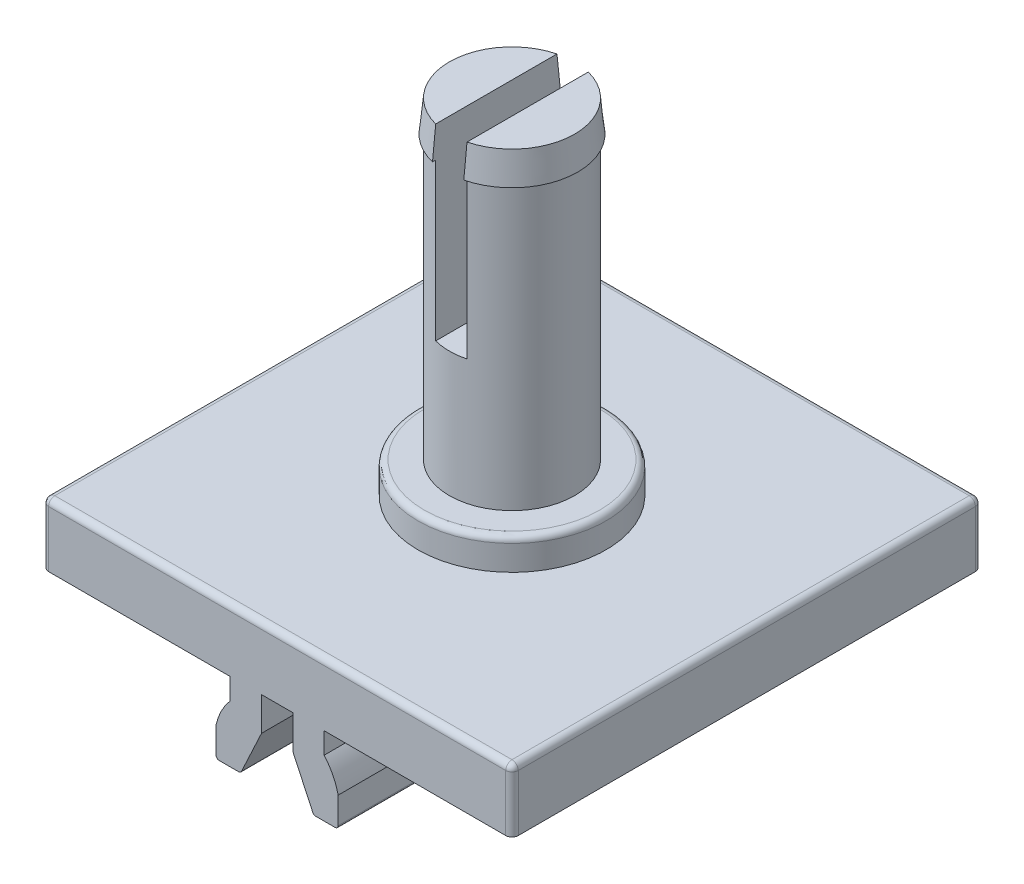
from build123d import *

# Parameters (mm, degrees)
SKETCH_1_W           = 15
SKETCH_1_H           = 15
EXTRUDE_1_DEPTH      = 2
SKETCH_2_R           = 3
EXTRUDE_2_DEPTH      = 1
SKETCH_3_R           = 2
EXTRUDE_3_DEPTH      = 10
SKETCH_5_W           = 1
SKETCH_5_H           = 6
CUT_EXTRUDE_1_DEPTH  = 6
EXTRUDE_4_DEPTH      = 7.5
EXTRUDE_4_DEPTH_BACK = 7.5
FILLET_1_R           = 0.2
FILLET_2_R           = 0.1


with BuildPart() as part:
    # Sketch 1 → Extrude 1 (new body)
    with BuildSketch(Plane(origin=(0, 0, 0), x_dir=(1, 0, 0), z_dir=(0, 1, 0))):
        Rectangle(SKETCH_1_W, SKETCH_1_H)
    extrude(amount=EXTRUDE_1_DEPTH)

    # Sketch 2 → Extrude 2 (add)
    with BuildSketch(Plane(origin=(0, 2, 0), x_dir=(1, 0, 0), z_dir=(0, 1, 0))):
        with Locations(Location((0, 0, 0), (0, 0, 90))):
            Circle(SKETCH_2_R)
    extrude(amount=EXTRUDE_2_DEPTH)

    # Sketch 3 → Extrude 3 (add)
    with BuildSketch(Plane(origin=(0, 3, 0), x_dir=(1, 0, 0), z_dir=(0, 1, 0))):
        with Locations(Location((0, 0, 0), (0, 0, 270))):
            Circle(SKETCH_3_R)
    extrude(amount=EXTRUDE_3_DEPTH)

    # Sketch 4 → Revolve 1 (revolve)
    with BuildSketch(Plane.XY, mode=Mode.PRIVATE) as revolve_1_sk:
        Polygon((0, 13), (-2, 13), (-2.1, 12), (0, 12), align=None)
    revolve(revolve_1_sk.sketch.rotate(Axis((0, 12, 0), (0, 1, 0)), 90), axis=Axis((0, 12, 0), (0, 1, 0)))

    # Sketch 5 → Cut-Extrude 1 (cut)
    with BuildSketch(Plane(origin=(0, 13, 0), x_dir=(1, 0, 0), z_dir=(0, 1, 0))):
        Rectangle(SKETCH_5_W, SKETCH_5_H)
    extrude(amount=-CUT_EXTRUDE_1_DEPTH, mode=Mode.SUBTRACT)

    # Sketch 6 → Extrude 4 (add, two sides: drawn at the far end of the back side and taken through both)
    with BuildSketch(Plane.XY.offset(-EXTRUDE_4_DEPTH_BACK)):
        with BuildLine():
            Line((-0.5, 0), (-1.5, 0))
            Line((-1.5, 0), (-1.5, -0.677124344))
            ThreePointArc((-1.5, -0.677124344), (-1.780042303, -1.088161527), (-1.95, -1.555590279))
            Line((-1.95, -1.555590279), (-1.95, -2.5))
            Line((-1.95, -2.5), (-1.165769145, -2.5))
            Line((-1.165769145, -2.5), (-0.5, -1.07225346))
            Line((-0.5, -1.07225346), (-0.5, 0))
        make_face()
        with BuildLine():
            Line((0.5, 0), (0.5, -1.07225346))
            Line((0.5, -1.07225346), (1.165769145, -2.5))
            Line((1.165769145, -2.5), (1.95, -2.5))
            Line((1.95, -2.5), (1.95, -1.555590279))
            ThreePointArc((1.95, -1.555590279), (1.780042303, -1.088161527), (1.5, -0.677124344))
            Line((1.5, -0.677124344), (1.5, 0))
            Line((1.5, 0), (0.5, 0))
        make_face()
    extrude(amount=EXTRUDE_4_DEPTH + EXTRUDE_4_DEPTH_BACK)

    # Fillet 1
    fillet_1_edges = [part.edges().sort_by_distance(p)[0] for p in [
        (-7.5, 1, -7.5),
        (7.5, 1, -7.5),
        (7.5, 1, 7.5),
        (-7.5, 1, 7.5),
        (7.5, 2, 0),
        (0, 2, -7.5),
        (-7.5, 2, 0),
        (0, 2, 7.5),
        (0, 3, 3),
    ]]
    fillet(fillet_1_edges, radius=FILLET_1_R)

    # Fillet 2
    fillet_2_edges = [part.edges().sort_by_distance(p)[0] for p in [
        (-1.165769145, -2.5, 0),
        (-1.95, -2.5, 0),
        (1.95, -2.5, 0),
        (1.165769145, -2.5, 0),
    ]]
    fillet(fillet_2_edges, radius=FILLET_2_R)


solid = part.part
